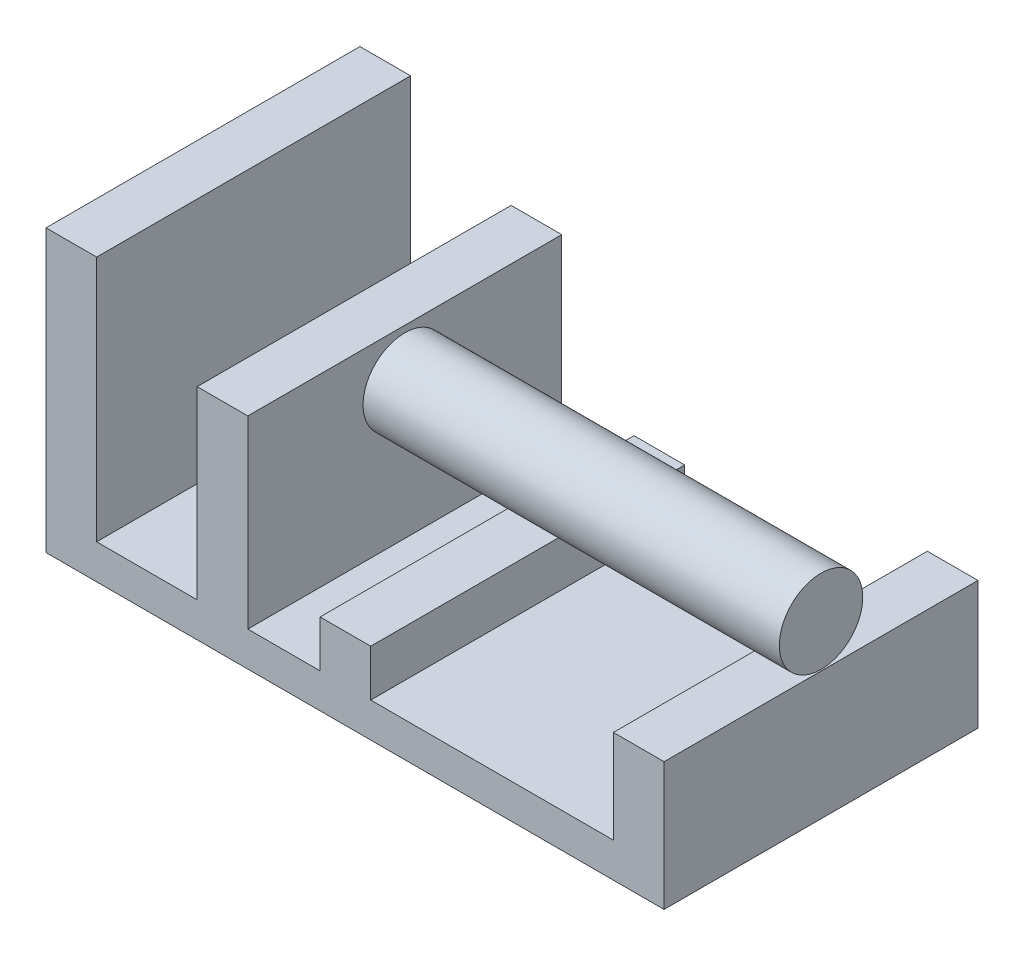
from build123d import *

# Parameters (mm, degrees)
EXTRUDE1_DEPTH      = 37.659494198
SKETCH2_R           = 10.012110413
BOSS_EXTRUDE1_DEPTH = 99.868653


with BuildPart() as part:
    # Sketch1 → Extrude1 (new, symmetric)
    with BuildSketch(Plane.XY):
        Polygon((0, 67.484549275), (0, 0), (148.290313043, 0), (148.290313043, 30.701558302), (136.137612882, 30.701558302), (136.137612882, 8.315005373), (77.910435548, 8.315005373), (77.910435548, 19.508281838), (65.757735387, 19.508281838), (65.757735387, 8.315005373), (48.421660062, 8.315005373), (48.421660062, 52.61436361), (36.2689599, 52.61436361), (36.2689599, 8.315005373), (12.152700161, 8.315005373), (12.152700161, 67.484549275), align=None)
    extrude(amount=EXTRUDE1_DEPTH, both=True)

    # Sketch2 → Boss-Extrude1 (add)
    with BuildSketch(Plane(origin=(148.290313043, 0, 0), x_dir=(0, 0, -1), z_dir=(1, 0, 0))):
        with Locations((0, 41.039791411)):
            Circle(SKETCH2_R)
    extrude(amount=-BOSS_EXTRUDE1_DEPTH)


solid = part.part
